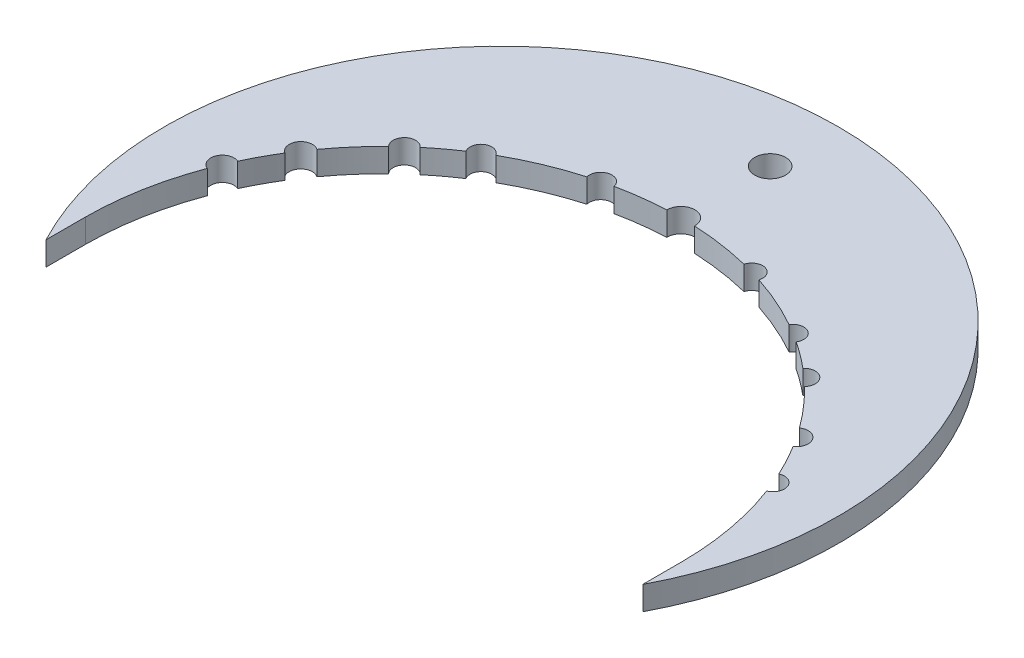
ISO-10303-21;
HEADER;
FILE_DESCRIPTION(('STEP AP214'),'2;1');
FILE_NAME('part.step','',(''),(''),'','','');
FILE_SCHEMA(('AUTOMOTIVE_DESIGN { 1 0 10303 214 1 1 1 1 }'));
ENDSEC;
DATA;
#1=APPLICATION_CONTEXT('core data for automotive mechanical design processes');
#2=APPLICATION_PROTOCOL_DEFINITION('international standard','automotive_design',2000,#1);
#3=PRODUCT_CONTEXT('',#1,'mechanical');
#4=PRODUCT('Part','Part','',(#3));
#5=PRODUCT_RELATED_PRODUCT_CATEGORY('part','',(#4));
#6=PRODUCT_DEFINITION_FORMATION('','',#4);
#7=PRODUCT_DEFINITION_CONTEXT('part definition',#1,'design');
#8=PRODUCT_DEFINITION('design','',#6,#7);
#9=PRODUCT_DEFINITION_SHAPE('','',#8);
#10=(LENGTH_UNIT() NAMED_UNIT(*) SI_UNIT(.MILLI.,.METRE.));
#11=(NAMED_UNIT(*) PLANE_ANGLE_UNIT() SI_UNIT($,.RADIAN.));
#12=(NAMED_UNIT(*) SI_UNIT($,.STERADIAN.) SOLID_ANGLE_UNIT());
#13=UNCERTAINTY_MEASURE_WITH_UNIT(LENGTH_MEASURE(1.E-05),#10,'distance_accuracy_value','');
#14=(GEOMETRIC_REPRESENTATION_CONTEXT(3) GLOBAL_UNCERTAINTY_ASSIGNED_CONTEXT((#13)) GLOBAL_UNIT_ASSIGNED_CONTEXT((#10,
#11,#12)) REPRESENTATION_CONTEXT('',''));
#15=CARTESIAN_POINT('',(0.,0.,0.));
#16=DIRECTION('',(0.,0.,1.));
#17=DIRECTION('',(1.,0.,0.));
#18=AXIS2_PLACEMENT_3D('',#15,#16,#17);
#19=CARTESIAN_POINT('',(19.2198140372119,5.,-60.7260260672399));
#20=DIRECTION('',(0.,-1.,0.));
#21=DIRECTION('',(0.,0.,-1.));
#22=AXIS2_PLACEMENT_3D('',#19,#20,#21);
#23=CYLINDRICAL_SURFACE('',#22,2.36515468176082);
#24=CARTESIAN_POINT('',(19.2198140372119,0.,-60.7260260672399));
#25=DIRECTION('',(0.,1.,0.));
#26=DIRECTION('',(0.,0.,1.));
#27=AXIS2_PLACEMENT_3D('',#24,#25,#26);
#28=CIRCLE('',#27,2.36515468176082);
#29=CARTESIAN_POINT('',(21.5261649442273,0.,-61.2501464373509));
#30=VERTEX_POINT('',#29);
#31=CARTESIAN_POINT('',(16.93482019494,0.,-60.115485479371));
#32=VERTEX_POINT('',#31);
#33=EDGE_CURVE('E254',#30,#32,#28,.T.);
#34=ORIENTED_EDGE('',*,*,#33,.F.);
#35=DIRECTION('',(0.,-1.,0.));
#36=VECTOR('',#35,1.);
#37=CARTESIAN_POINT('',(21.5261649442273,5.,-61.2501464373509));
#38=LINE('',#37,#36);
#39=CARTESIAN_POINT('',(21.5261649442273,5.,-61.2501464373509));
#40=VERTEX_POINT('',#39);
#41=EDGE_CURVE('E11',#40,#30,#38,.T.);
#42=ORIENTED_EDGE('',*,*,#41,.F.);
#43=CARTESIAN_POINT('',(19.2198140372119,5.,-60.7260260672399));
#44=DIRECTION('',(0.,1.,0.));
#45=DIRECTION('',(0.,0.,1.));
#46=AXIS2_PLACEMENT_3D('',#43,#44,#45);
#47=CIRCLE('',#46,2.36515468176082);
#48=CARTESIAN_POINT('',(16.93482019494,5.,-60.115485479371));
#49=VERTEX_POINT('',#48);
#50=EDGE_CURVE('E326',#40,#49,#47,.T.);
#51=ORIENTED_EDGE('',*,*,#50,.T.);
#52=DIRECTION('',(0.,-1.,0.));
#53=VECTOR('',#52,1.);
#54=CARTESIAN_POINT('',(16.93482019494,5.,-60.115485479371));
#55=LINE('',#54,#53);
#56=EDGE_CURVE('E146',#49,#32,#55,.T.);
#57=ORIENTED_EDGE('',*,*,#56,.T.);
#58=EDGE_LOOP('',(#34,#42,#51,#57));
#59=FACE_BOUND('',#58,.T.);
#60=ADVANCED_FACE('F41',(#59),#23,.F.);
#61=CARTESIAN_POINT('',(34.2957576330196,5.,0.277971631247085));
#62=DIRECTION('',(0.,-1.,0.));
#63=DIRECTION('',(0.,0.,-1.));
#64=AXIS2_PLACEMENT_3D('',#61,#62,#63);
#65=CYLINDRICAL_SURFACE('',#64,62.8392537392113);
#66=CARTESIAN_POINT('',(34.2957576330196,0.,0.277971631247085));
#67=DIRECTION('',(0.,1.,0.));
#68=DIRECTION('',(0.,0.,1.));
#69=AXIS2_PLACEMENT_3D('',#66,#67,#68);
#70=CIRCLE('',#69,62.8392537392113);
#71=CARTESIAN_POINT('',(31.374357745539,0.,-62.4933373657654));
#72=VERTEX_POINT('',#71);
#73=EDGE_CURVE('E258',#30,#72,#70,.F.);
#74=ORIENTED_EDGE('',*,*,#73,.T.);
#75=DIRECTION('',(0.,-1.,0.));
#76=VECTOR('',#75,1.);
#77=CARTESIAN_POINT('',(31.374357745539,5.,-62.4933373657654));
#78=LINE('',#77,#76);
#79=CARTESIAN_POINT('',(31.374357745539,5.,-62.4933373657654));
#80=VERTEX_POINT('',#79);
#81=EDGE_CURVE('E50',#80,#72,#78,.T.);
#82=ORIENTED_EDGE('',*,*,#81,.F.);
#83=CARTESIAN_POINT('',(34.2957576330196,5.,0.277971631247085));
#84=DIRECTION('',(0.,1.,0.));
#85=DIRECTION('',(0.,0.,1.));
#86=AXIS2_PLACEMENT_3D('',#83,#84,#85);
#87=CIRCLE('',#86,62.8392537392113);
#88=EDGE_CURVE('E247',#40,#80,#87,.F.);
#89=ORIENTED_EDGE('',*,*,#88,.F.);
#90=ORIENTED_EDGE('',*,*,#41,.T.);
#91=EDGE_LOOP('',(#74,#82,#89,#90));
#92=FACE_BOUND('',#91,.T.);
#93=ADVANCED_FACE('F404',(#92),#65,.F.);
#94=CARTESIAN_POINT('',(34.2957576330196,5.,-62.5612821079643));
#95=DIRECTION('',(0.,-1.,0.));
#96=DIRECTION('',(0.,0.,-1.));
#97=AXIS2_PLACEMENT_3D('',#94,#95,#96);
#98=CYLINDRICAL_SURFACE('',#97,2.92218989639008);
#99=CARTESIAN_POINT('',(34.2957576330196,0.,-62.5612821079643));
#100=DIRECTION('',(0.,1.,0.));
#101=DIRECTION('',(0.,0.,1.));
#102=AXIS2_PLACEMENT_3D('',#99,#100,#101);
#103=CIRCLE('',#102,2.92218989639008);
#104=CARTESIAN_POINT('',(37.2171575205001,0.,-62.4933373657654));
#105=VERTEX_POINT('',#104);
#106=EDGE_CURVE('E262',#105,#72,#103,.T.);
#107=ORIENTED_EDGE('',*,*,#106,.F.);
#108=DIRECTION('',(0.,-1.,0.));
#109=VECTOR('',#108,1.);
#110=CARTESIAN_POINT('',(37.2171575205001,5.,-62.4933373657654));
#111=LINE('',#110,#109);
#112=CARTESIAN_POINT('',(37.2171575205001,5.,-62.4933373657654));
#113=VERTEX_POINT('',#112);
#114=EDGE_CURVE('E392',#113,#105,#111,.T.);
#115=ORIENTED_EDGE('',*,*,#114,.F.);
#116=CARTESIAN_POINT('',(34.2957576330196,5.,-62.5612821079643));
#117=DIRECTION('',(0.,1.,0.));
#118=DIRECTION('',(0.,0.,1.));
#119=AXIS2_PLACEMENT_3D('',#116,#117,#118);
#120=CIRCLE('',#119,2.92218989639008);
#121=EDGE_CURVE('E401',#113,#80,#120,.T.);
#122=ORIENTED_EDGE('',*,*,#121,.T.);
#123=ORIENTED_EDGE('',*,*,#81,.T.);
#124=EDGE_LOOP('',(#107,#115,#122,#123));
#125=FACE_BOUND('',#124,.T.);
#126=ADVANCED_FACE('F399',(#125),#98,.F.);
#127=CARTESIAN_POINT('',(49.412267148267,0.,-60.7159866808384));
#128=VERTEX_POINT('',#127);
#129=EDGE_CURVE('E264',#105,#128,#70,.F.);
#130=ORIENTED_EDGE('',*,*,#129,.T.);
#131=DIRECTION('',(0.,-1.,0.));
#132=VECTOR('',#131,1.);
#133=CARTESIAN_POINT('',(49.412267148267,5.,-60.7159866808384));
#134=LINE('',#133,#132);
#135=CARTESIAN_POINT('',(49.412267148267,5.,-60.7159866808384));
#136=VERTEX_POINT('',#135);
#137=EDGE_CURVE('E389',#136,#128,#134,.T.);
#138=ORIENTED_EDGE('',*,*,#137,.F.);
#139=EDGE_CURVE('E594',#113,#136,#87,.F.);
#140=ORIENTED_EDGE('',*,*,#139,.F.);
#141=ORIENTED_EDGE('',*,*,#114,.T.);
#142=EDGE_LOOP('',(#130,#138,#140,#141));
#143=FACE_BOUND('',#142,.T.);
#144=ADVANCED_FACE('F461',(#143),#65,.F.);
#145=CARTESIAN_POINT('',(51.6359486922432,5.,-60.1214454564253));
#146=DIRECTION('',(0.,-1.,0.));
#147=DIRECTION('',(0.,0.,-1.));
#148=AXIS2_PLACEMENT_3D('',#145,#146,#147);
#149=CYLINDRICAL_SURFACE('',#148,2.30179036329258);
#150=CARTESIAN_POINT('',(51.6359486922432,0.,-60.1214454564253));
#151=DIRECTION('',(0.,1.,0.));
#152=DIRECTION('',(0.,0.,1.));
#153=AXIS2_PLACEMENT_3D('',#150,#151,#152);
#154=CIRCLE('',#153,2.30179036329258);
#155=CARTESIAN_POINT('',(53.8363641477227,0.,-59.4458637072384));
#156=VERTEX_POINT('',#155);
#157=EDGE_CURVE('E268',#156,#128,#154,.T.);
#158=ORIENTED_EDGE('',*,*,#157,.F.);
#159=DIRECTION('',(0.,-1.,0.));
#160=VECTOR('',#159,1.);
#161=CARTESIAN_POINT('',(53.8363641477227,5.,-59.4458637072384));
#162=LINE('',#161,#160);
#163=CARTESIAN_POINT('',(53.8363641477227,5.,-59.4458637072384));
#164=VERTEX_POINT('',#163);
#165=EDGE_CURVE('E386',#164,#156,#162,.T.);
#166=ORIENTED_EDGE('',*,*,#165,.F.);
#167=CARTESIAN_POINT('',(51.6359486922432,5.,-60.1214454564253));
#168=DIRECTION('',(0.,1.,0.));
#169=DIRECTION('',(0.,0.,1.));
#170=AXIS2_PLACEMENT_3D('',#167,#168,#169);
#171=CIRCLE('',#170,2.30179036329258);
#172=EDGE_CURVE('E597',#164,#136,#171,.T.);
#173=ORIENTED_EDGE('',*,*,#172,.T.);
#174=ORIENTED_EDGE('',*,*,#137,.T.);
#175=EDGE_LOOP('',(#158,#166,#173,#174));
#176=FACE_BOUND('',#175,.T.);
#177=ADVANCED_FACE('F468',(#176),#149,.F.);
#178=CARTESIAN_POINT('',(65.1790621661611,0.,-54.448560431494));
#179=VERTEX_POINT('',#178);
#180=EDGE_CURVE('E272',#156,#179,#70,.F.);
#181=ORIENTED_EDGE('',*,*,#180,.T.);
#182=DIRECTION('',(0.,-1.,0.));
#183=VECTOR('',#182,1.);
#184=CARTESIAN_POINT('',(65.1790621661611,5.,-54.448560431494));
#185=LINE('',#184,#183);
#186=CARTESIAN_POINT('',(65.1790621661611,5.,-54.448560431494));
#187=VERTEX_POINT('',#186);
#188=EDGE_CURVE('E383',#187,#179,#185,.T.);
#189=ORIENTED_EDGE('',*,*,#188,.F.);
#190=EDGE_CURVE('E601',#164,#187,#87,.F.);
#191=ORIENTED_EDGE('',*,*,#190,.F.);
#192=ORIENTED_EDGE('',*,*,#165,.T.);
#193=EDGE_LOOP('',(#181,#189,#191,#192));
#194=FACE_BOUND('',#193,.T.);
#195=ADVANCED_FACE('F469',(#194),#65,.F.);
#196=CARTESIAN_POINT('',(67.1453030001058,5.,-53.2914149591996));
#197=DIRECTION('',(0.,-1.,0.));
#198=DIRECTION('',(0.,0.,-1.));
#199=AXIS2_PLACEMENT_3D('',#196,#197,#198);
#200=CYLINDRICAL_SURFACE('',#199,2.28146634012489);
#201=CARTESIAN_POINT('',(67.1453030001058,0.,-53.2914149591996));
#202=DIRECTION('',(0.,1.,0.));
#203=DIRECTION('',(0.,0.,1.));
#204=AXIS2_PLACEMENT_3D('',#201,#202,#203);
#205=CIRCLE('',#204,2.28146634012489);
#206=CARTESIAN_POINT('',(69.0682430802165,0.,-52.0636567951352));
#207=VERTEX_POINT('',#206);
#208=EDGE_CURVE('E273',#207,#179,#205,.T.);
#209=ORIENTED_EDGE('',*,*,#208,.F.);
#210=DIRECTION('',(0.,-1.,0.));
#211=VECTOR('',#210,1.);
#212=CARTESIAN_POINT('',(69.0682430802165,5.,-52.0636567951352));
#213=LINE('',#212,#211);
#214=CARTESIAN_POINT('',(69.0682430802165,5.,-52.0636567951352));
#215=VERTEX_POINT('',#214);
#216=EDGE_CURVE('E380',#215,#207,#213,.T.);
#217=ORIENTED_EDGE('',*,*,#216,.F.);
#218=CARTESIAN_POINT('',(67.1453030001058,5.,-53.2914149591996));
#219=DIRECTION('',(0.,1.,0.));
#220=DIRECTION('',(0.,0.,1.));
#221=AXIS2_PLACEMENT_3D('',#218,#219,#220);
#222=CIRCLE('',#221,2.28146634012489);
#223=EDGE_CURVE('E602',#215,#187,#222,.T.);
#224=ORIENTED_EDGE('',*,*,#223,.T.);
#225=ORIENTED_EDGE('',*,*,#188,.T.);
#226=EDGE_LOOP('',(#209,#217,#224,#225));
#227=FACE_BOUND('',#226,.T.);
#228=ADVANCED_FACE('F539',(#227),#200,.F.);
#229=CARTESIAN_POINT('',(74.5943812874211,0.,-47.9381329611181));
#230=VERTEX_POINT('',#229);
#231=EDGE_CURVE('E277',#207,#230,#70,.F.);
#232=ORIENTED_EDGE('',*,*,#231,.T.);
#233=DIRECTION('',(0.,-1.,0.));
#234=VECTOR('',#233,1.);
#235=CARTESIAN_POINT('',(74.5943812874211,5.,-47.9381329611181));
#236=LINE('',#235,#234);
#237=CARTESIAN_POINT('',(74.5943812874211,5.,-47.9381329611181));
#238=VERTEX_POINT('',#237);
#239=EDGE_CURVE('E377',#238,#230,#236,.T.);
#240=ORIENTED_EDGE('',*,*,#239,.F.);
#241=EDGE_CURVE('E606',#215,#238,#87,.F.);
#242=ORIENTED_EDGE('',*,*,#241,.F.);
#243=ORIENTED_EDGE('',*,*,#216,.T.);
#244=EDGE_LOOP('',(#232,#240,#242,#243));
#245=FACE_BOUND('',#244,.T.);
#246=ADVANCED_FACE('F532',(#245),#65,.F.);
#247=CARTESIAN_POINT('',(76.3714492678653,5.,-46.395446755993));
#248=DIRECTION('',(0.,-1.,0.));
#249=DIRECTION('',(0.,0.,-1.));
#250=AXIS2_PLACEMENT_3D('',#247,#248,#249);
#251=CYLINDRICAL_SURFACE('',#250,2.35326397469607);
#252=CARTESIAN_POINT('',(76.3714492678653,0.,-46.395446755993));
#253=DIRECTION('',(0.,1.,0.));
#254=DIRECTION('',(0.,0.,1.));
#255=AXIS2_PLACEMENT_3D('',#252,#253,#254);
#256=CIRCLE('',#255,2.35326397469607);
#257=CARTESIAN_POINT('',(78.0895092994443,0.,-44.7873046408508));
#258=VERTEX_POINT('',#257);
#259=EDGE_CURVE('E278',#258,#230,#256,.T.);
#260=ORIENTED_EDGE('',*,*,#259,.F.);
#261=DIRECTION('',(0.,-1.,0.));
#262=VECTOR('',#261,1.);
#263=CARTESIAN_POINT('',(78.0895092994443,5.,-44.7873046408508));
#264=LINE('',#263,#262);
#265=CARTESIAN_POINT('',(78.0895092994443,5.,-44.7873046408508));
#266=VERTEX_POINT('',#265);
#267=EDGE_CURVE('E374',#266,#258,#264,.T.);
#268=ORIENTED_EDGE('',*,*,#267,.F.);
#269=CARTESIAN_POINT('',(76.3714492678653,5.,-46.395446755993));
#270=DIRECTION('',(0.,1.,0.));
#271=DIRECTION('',(0.,0.,1.));
#272=AXIS2_PLACEMENT_3D('',#269,#270,#271);
#273=CIRCLE('',#272,2.35326397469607);
#274=EDGE_CURVE('E607',#266,#238,#273,.T.);
#275=ORIENTED_EDGE('',*,*,#274,.T.);
#276=ORIENTED_EDGE('',*,*,#239,.T.);
#277=EDGE_LOOP('',(#260,#268,#275,#276));
#278=FACE_BOUND('',#277,.T.);
#279=ADVANCED_FACE('F531',(#278),#251,.F.);
#280=CARTESIAN_POINT('',(85.1011740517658,0.,-36.7028541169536));
#281=VERTEX_POINT('',#280);
#282=EDGE_CURVE('E282',#258,#281,#70,.F.);
#283=ORIENTED_EDGE('',*,*,#282,.T.);
#284=DIRECTION('',(0.,-1.,0.));
#285=VECTOR('',#284,1.);
#286=CARTESIAN_POINT('',(85.1011740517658,5.,-36.7028541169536));
#287=LINE('',#286,#285);
#288=CARTESIAN_POINT('',(85.1011740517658,5.,-36.7028541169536));
#289=VERTEX_POINT('',#288);
#290=EDGE_CURVE('E371',#289,#281,#287,.T.);
#291=ORIENTED_EDGE('',*,*,#290,.F.);
#292=EDGE_CURVE('E611',#266,#289,#87,.F.);
#293=ORIENTED_EDGE('',*,*,#292,.F.);
#294=ORIENTED_EDGE('',*,*,#267,.T.);
#295=EDGE_LOOP('',(#283,#291,#293,#294));
#296=FACE_BOUND('',#295,.T.);
#297=ADVANCED_FACE('F524',(#296),#65,.F.);
#298=CARTESIAN_POINT('',(86.4952526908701,5.,-34.7075185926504));
#299=DIRECTION('',(0.,-1.,0.));
#300=DIRECTION('',(0.,0.,-1.));
#301=AXIS2_PLACEMENT_3D('',#298,#299,#300);
#302=CYLINDRICAL_SURFACE('',#301,2.43409513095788);
#303=CARTESIAN_POINT('',(86.4952526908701,0.,-34.7075185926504));
#304=DIRECTION('',(0.,1.,0.));
#305=DIRECTION('',(0.,0.,1.));
#306=AXIS2_PLACEMENT_3D('',#303,#304,#305);
#307=CIRCLE('',#306,2.43409513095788);
#308=CARTESIAN_POINT('',(87.8110101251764,0.,-32.6596901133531));
#309=VERTEX_POINT('',#308);
#310=EDGE_CURVE('E283',#309,#281,#307,.T.);
#311=ORIENTED_EDGE('',*,*,#310,.F.);
#312=DIRECTION('',(0.,-1.,0.));
#313=VECTOR('',#312,1.);
#314=CARTESIAN_POINT('',(87.8110101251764,5.,-32.6596901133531));
#315=LINE('',#314,#313);
#316=CARTESIAN_POINT('',(87.8110101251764,5.,-32.6596901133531));
#317=VERTEX_POINT('',#316);
#318=EDGE_CURVE('E368',#317,#309,#315,.T.);
#319=ORIENTED_EDGE('',*,*,#318,.F.);
#320=CARTESIAN_POINT('',(86.4952526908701,5.,-34.7075185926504));
#321=DIRECTION('',(0.,1.,0.));
#322=DIRECTION('',(0.,0.,1.));
#323=AXIS2_PLACEMENT_3D('',#320,#321,#322);
#324=CIRCLE('',#323,2.43409513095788);
#325=EDGE_CURVE('E612',#317,#289,#324,.T.);
#326=ORIENTED_EDGE('',*,*,#325,.T.);
#327=ORIENTED_EDGE('',*,*,#290,.T.);
#328=EDGE_LOOP('',(#311,#319,#326,#327));
#329=FACE_BOUND('',#328,.T.);
#330=ADVANCED_FACE('F523',(#329),#302,.F.);
#331=CARTESIAN_POINT('',(91.3080598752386,0.,-26.1487043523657));
#332=VERTEX_POINT('',#331);
#333=EDGE_CURVE('E287',#309,#332,#70,.F.);
#334=ORIENTED_EDGE('',*,*,#333,.T.);
#335=DIRECTION('',(0.,-1.,0.));
#336=VECTOR('',#335,1.);
#337=CARTESIAN_POINT('',(91.3080598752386,5.,-26.1487043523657));
#338=LINE('',#337,#336);
#339=CARTESIAN_POINT('',(91.3080598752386,5.,-26.1487043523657));
#340=VERTEX_POINT('',#339);
#341=EDGE_CURVE('E365',#340,#332,#338,.T.);
#342=ORIENTED_EDGE('',*,*,#341,.F.);
#343=EDGE_CURVE('E616',#317,#340,#87,.F.);
#344=ORIENTED_EDGE('',*,*,#343,.F.);
#345=ORIENTED_EDGE('',*,*,#318,.T.);
#346=EDGE_LOOP('',(#334,#342,#344,#345));
#347=FACE_BOUND('',#346,.T.);
#348=ADVANCED_FACE('F513',(#347),#65,.F.);
#349=CARTESIAN_POINT('',(92.2695068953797,5.,-23.9669496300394));
#350=DIRECTION('',(0.,-1.,0.));
#351=DIRECTION('',(0.,0.,-1.));
#352=AXIS2_PLACEMENT_3D('',#349,#350,#351);
#353=CYLINDRICAL_SURFACE('',#352,2.3842051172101);
#354=CARTESIAN_POINT('',(92.2695068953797,0.,-23.9669496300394));
#355=DIRECTION('',(0.,1.,0.));
#356=DIRECTION('',(0.,0.,1.));
#357=AXIS2_PLACEMENT_3D('',#354,#355,#356);
#358=CIRCLE('',#357,2.3842051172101);
#359=CARTESIAN_POINT('',(93.1474981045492,0.,-21.7502932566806));
#360=VERTEX_POINT('',#359);
#361=EDGE_CURVE('E288',#360,#332,#358,.T.);
#362=ORIENTED_EDGE('',*,*,#361,.F.);
#363=DIRECTION('',(0.,-1.,0.));
#364=VECTOR('',#363,1.);
#365=CARTESIAN_POINT('',(93.1474981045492,5.,-21.7502932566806));
#366=LINE('',#365,#364);
#367=CARTESIAN_POINT('',(93.1474981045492,5.,-21.7502932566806));
#368=VERTEX_POINT('',#367);
#369=EDGE_CURVE('E362',#368,#360,#366,.T.);
#370=ORIENTED_EDGE('',*,*,#369,.F.);
#371=CARTESIAN_POINT('',(92.2695068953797,5.,-23.9669496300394));
#372=DIRECTION('',(0.,1.,0.));
#373=DIRECTION('',(0.,0.,1.));
#374=AXIS2_PLACEMENT_3D('',#371,#372,#373);
#375=CIRCLE('',#374,2.3842051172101);
#376=EDGE_CURVE('E617',#368,#340,#375,.T.);
#377=ORIENTED_EDGE('',*,*,#376,.T.);
#378=ORIENTED_EDGE('',*,*,#341,.T.);
#379=EDGE_LOOP('',(#362,#370,#377,#378));
#380=FACE_BOUND('',#379,.T.);
#381=ADVANCED_FACE('F512',(#380),#353,.F.);
#382=CARTESIAN_POINT('',(97.134396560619,0.,0.));
#383=VERTEX_POINT('',#382);
#384=EDGE_CURVE('E292',#360,#383,#70,.F.);
#385=ORIENTED_EDGE('',*,*,#384,.T.);
#386=DIRECTION('',(0.,-1.,0.));
#387=VECTOR('',#386,1.);
#388=CARTESIAN_POINT('',(97.134396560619,5.,0.));
#389=LINE('',#388,#387);
#390=CARTESIAN_POINT('',(97.134396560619,5.,0.));
#391=VERTEX_POINT('',#390);
#392=EDGE_CURVE('E358',#391,#383,#389,.T.);
#393=ORIENTED_EDGE('',*,*,#392,.F.);
#394=EDGE_CURVE('E575',#368,#391,#87,.F.);
#395=ORIENTED_EDGE('',*,*,#394,.F.);
#396=ORIENTED_EDGE('',*,*,#369,.T.);
#397=EDGE_LOOP('',(#385,#393,#395,#396));
#398=FACE_BOUND('',#397,.T.);
#399=ADVANCED_FACE('F503',(#398),#65,.F.);
#400=CARTESIAN_POINT('',(97.134396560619,5.,0.));
#401=DIRECTION('',(1.,0.,0.));
#402=DIRECTION('',(0.,0.,-1.));
#403=AXIS2_PLACEMENT_3D('',#400,#401,#402);
#404=PLANE('',#403);
#405=DIRECTION('',(0.,0.,1.));
#406=VECTOR('',#405,1.);
#407=CARTESIAN_POINT('',(97.134396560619,0.,0.));
#408=LINE('',#407,#406);
#409=CARTESIAN_POINT('',(97.134396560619,0.,8.31306140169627));
#410=VERTEX_POINT('',#409);
#411=EDGE_CURVE('E293',#383,#410,#408,.T.);
#412=ORIENTED_EDGE('',*,*,#411,.T.);
#413=DIRECTION('',(0.,-1.,0.));
#414=VECTOR('',#413,1.);
#415=CARTESIAN_POINT('',(97.134396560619,5.,8.31306140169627));
#416=LINE('',#415,#414);
#417=CARTESIAN_POINT('',(97.134396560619,5.,8.31306140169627));
#418=VERTEX_POINT('',#417);
#419=EDGE_CURVE('E354',#418,#410,#416,.T.);
#420=ORIENTED_EDGE('',*,*,#419,.F.);
#421=DIRECTION('',(0.,0.,1.));
#422=VECTOR('',#421,1.);
#423=CARTESIAN_POINT('',(97.134396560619,5.,0.));
#424=LINE('',#423,#422);
#425=EDGE_CURVE('E577',#391,#418,#424,.T.);
#426=ORIENTED_EDGE('',*,*,#425,.F.);
#427=ORIENTED_EDGE('',*,*,#392,.T.);
#428=EDGE_LOOP('',(#412,#420,#426,#427));
#429=FACE_BOUND('',#428,.T.);
#430=ADVANCED_FACE('F511',(#429),#404,.F.);
#431=CARTESIAN_POINT('',(34.2957576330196,5.,-24.733413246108));
#432=DIRECTION('',(0.,-1.,0.));
#433=DIRECTION('',(0.,0.,-1.));
#434=AXIS2_PLACEMENT_3D('',#431,#432,#433);
#435=CYLINDRICAL_SURFACE('',#434,70.9983382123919);
#436=CARTESIAN_POINT('',(34.2957576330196,0.,-24.733413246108));
#437=DIRECTION('',(0.,1.,0.));
#438=DIRECTION('',(0.,0.,1.));
#439=AXIS2_PLACEMENT_3D('',#436,#437,#438);
#440=CIRCLE('',#439,70.9983382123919);
#441=CARTESIAN_POINT('',(-28.5428812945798,0.,8.31306140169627));
#442=VERTEX_POINT('',#441);
#443=EDGE_CURVE('E296',#410,#442,#440,.T.);
#444=ORIENTED_EDGE('',*,*,#443,.T.);
#445=DIRECTION('',(0.,-1.,0.));
#446=VECTOR('',#445,1.);
#447=CARTESIAN_POINT('',(-28.5428812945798,5.,8.31306140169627));
#448=LINE('',#447,#446);
#449=CARTESIAN_POINT('',(-28.5428812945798,5.,8.31306140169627));
#450=VERTEX_POINT('',#449);
#451=EDGE_CURVE('E351',#450,#442,#448,.T.);
#452=ORIENTED_EDGE('',*,*,#451,.F.);
#453=CARTESIAN_POINT('',(34.2957576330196,5.,-24.733413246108));
#454=DIRECTION('',(0.,1.,0.));
#455=DIRECTION('',(0.,0.,1.));
#456=AXIS2_PLACEMENT_3D('',#453,#454,#455);
#457=CIRCLE('',#456,70.9983382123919);
#458=EDGE_CURVE('E570',#418,#450,#457,.T.);
#459=ORIENTED_EDGE('',*,*,#458,.F.);
#460=ORIENTED_EDGE('',*,*,#419,.T.);
#461=EDGE_LOOP('',(#444,#452,#459,#460));
#462=FACE_BOUND('',#461,.T.);
#463=ADVANCED_FACE('F507',(#462),#435,.T.);
#464=CARTESIAN_POINT('',(-28.5428812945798,5.,0.));
#465=DIRECTION('',(1.,0.,0.));
#466=DIRECTION('',(0.,0.,-1.));
#467=AXIS2_PLACEMENT_3D('',#464,#465,#466);
#468=PLANE('',#467);
#469=DIRECTION('',(0.,0.,1.));
#470=VECTOR('',#469,1.);
#471=CARTESIAN_POINT('',(-28.5428812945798,0.,0.));
#472=LINE('',#471,#470);
#473=CARTESIAN_POINT('',(-28.5428812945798,0.,0.));
#474=VERTEX_POINT('',#473);
#475=EDGE_CURVE('E300',#474,#442,#472,.T.);
#476=ORIENTED_EDGE('',*,*,#475,.F.);
#477=DIRECTION('',(0.,-1.,0.));
#478=VECTOR('',#477,1.);
#479=CARTESIAN_POINT('',(-28.5428812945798,5.,0.));
#480=LINE('',#479,#478);
#481=CARTESIAN_POINT('',(-28.5428812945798,5.,0.));
#482=VERTEX_POINT('',#481);
#483=EDGE_CURVE('E348',#482,#474,#480,.T.);
#484=ORIENTED_EDGE('',*,*,#483,.F.);
#485=DIRECTION('',(0.,0.,1.));
#486=VECTOR('',#485,1.);
#487=CARTESIAN_POINT('',(-28.5428812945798,5.,0.));
#488=LINE('',#487,#486);
#489=EDGE_CURVE('E567',#482,#450,#488,.T.);
#490=ORIENTED_EDGE('',*,*,#489,.T.);
#491=ORIENTED_EDGE('',*,*,#451,.T.);
#492=EDGE_LOOP('',(#476,#484,#490,#491));
#493=FACE_BOUND('',#492,.T.);
#494=ADVANCED_FACE('F502',(#493),#468,.T.);
#495=CARTESIAN_POINT('',(-24.5787848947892,0.,-21.6892779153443));
#496=VERTEX_POINT('',#495);
#497=EDGE_CURVE('E304',#474,#496,#70,.F.);
#498=ORIENTED_EDGE('',*,*,#497,.T.);
#499=DIRECTION('',(0.,-1.,0.));
#500=VECTOR('',#499,1.);
#501=CARTESIAN_POINT('',(-24.5787848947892,5.,-21.6892779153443));
#502=LINE('',#501,#500);
#503=CARTESIAN_POINT('',(-24.5787848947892,5.,-21.6892779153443));
#504=VERTEX_POINT('',#503);
#505=EDGE_CURVE('E345',#504,#496,#502,.T.);
#506=ORIENTED_EDGE('',*,*,#505,.F.);
#507=EDGE_CURVE('E569',#482,#504,#87,.F.);
#508=ORIENTED_EDGE('',*,*,#507,.F.);
#509=ORIENTED_EDGE('',*,*,#483,.T.);
#510=EDGE_LOOP('',(#498,#506,#508,#509));
#511=FACE_BOUND('',#510,.T.);
#512=ADVANCED_FACE('F495',(#511),#65,.F.);
#513=CARTESIAN_POINT('',(-23.6779916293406,5.,-23.9669496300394));
#514=DIRECTION('',(0.,-1.,0.));
#515=DIRECTION('',(0.,0.,-1.));
#516=AXIS2_PLACEMENT_3D('',#513,#514,#515);
#517=CYLINDRICAL_SURFACE('',#516,2.44932989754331);
#518=CARTESIAN_POINT('',(-23.6779916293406,0.,-23.9669496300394));
#519=DIRECTION('',(0.,1.,0.));
#520=DIRECTION('',(0.,0.,1.));
#521=AXIS2_PLACEMENT_3D('',#518,#519,#520);
#522=CIRCLE('',#521,2.44932989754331);
#523=CARTESIAN_POINT('',(-22.6891210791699,0.,-26.2077869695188));
#524=VERTEX_POINT('',#523);
#525=EDGE_CURVE('E305',#524,#496,#522,.T.);
#526=ORIENTED_EDGE('',*,*,#525,.F.);
#527=DIRECTION('',(0.,-1.,0.));
#528=VECTOR('',#527,1.);
#529=CARTESIAN_POINT('',(-22.6891210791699,5.,-26.2077869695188));
#530=LINE('',#529,#528);
#531=CARTESIAN_POINT('',(-22.6891210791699,5.,-26.2077869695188));
#532=VERTEX_POINT('',#531);
#533=EDGE_CURVE('E342',#532,#524,#530,.T.);
#534=ORIENTED_EDGE('',*,*,#533,.F.);
#535=CARTESIAN_POINT('',(-23.6779916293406,5.,-23.9669496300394));
#536=DIRECTION('',(0.,1.,0.));
#537=DIRECTION('',(0.,0.,1.));
#538=AXIS2_PLACEMENT_3D('',#535,#536,#537);
#539=CIRCLE('',#538,2.44932989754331);
#540=EDGE_CURVE('E574',#532,#504,#539,.T.);
#541=ORIENTED_EDGE('',*,*,#540,.T.);
#542=ORIENTED_EDGE('',*,*,#505,.T.);
#543=EDGE_LOOP('',(#526,#534,#541,#542));
#544=FACE_BOUND('',#543,.T.);
#545=ADVANCED_FACE('F494',(#544),#517,.F.);
#546=CARTESIAN_POINT('',(-19.2194948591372,0.,-32.6596901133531));
#547=VERTEX_POINT('',#546);
#548=EDGE_CURVE('E309',#524,#547,#70,.F.);
#549=ORIENTED_EDGE('',*,*,#548,.T.);
#550=DIRECTION('',(0.,-1.,0.));
#551=VECTOR('',#550,1.);
#552=CARTESIAN_POINT('',(-19.2194948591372,5.,-32.6596901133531));
#553=LINE('',#552,#551);
#554=CARTESIAN_POINT('',(-19.2194948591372,5.,-32.6596901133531));
#555=VERTEX_POINT('',#554);
#556=EDGE_CURVE('E339',#555,#547,#553,.T.);
#557=ORIENTED_EDGE('',*,*,#556,.F.);
#558=EDGE_CURVE('E576',#532,#555,#87,.F.);
#559=ORIENTED_EDGE('',*,*,#558,.F.);
#560=ORIENTED_EDGE('',*,*,#533,.T.);
#561=EDGE_LOOP('',(#549,#557,#559,#560));
#562=FACE_BOUND('',#561,.T.);
#563=ADVANCED_FACE('F487',(#562),#65,.F.);
#564=CARTESIAN_POINT('',(-17.9037374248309,5.,-34.7075185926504));
#565=DIRECTION('',(0.,-1.,0.));
#566=DIRECTION('',(0.,0.,-1.));
#567=AXIS2_PLACEMENT_3D('',#564,#565,#566);
#568=CYLINDRICAL_SURFACE('',#567,2.43409513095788);
#569=CARTESIAN_POINT('',(-17.9037374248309,0.,-34.7075185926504));
#570=DIRECTION('',(0.,1.,0.));
#571=DIRECTION('',(0.,0.,1.));
#572=AXIS2_PLACEMENT_3D('',#569,#570,#571);
#573=CIRCLE('',#572,2.43409513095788);
#574=CARTESIAN_POINT('',(-16.5096587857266,0.,-36.7028541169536));
#575=VERTEX_POINT('',#574);
#576=EDGE_CURVE('E310',#575,#547,#573,.T.);
#577=ORIENTED_EDGE('',*,*,#576,.F.);
#578=DIRECTION('',(0.,-1.,0.));
#579=VECTOR('',#578,1.);
#580=CARTESIAN_POINT('',(-16.5096587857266,5.,-36.7028541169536));
#581=LINE('',#580,#579);
#582=CARTESIAN_POINT('',(-16.5096587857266,5.,-36.7028541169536));
#583=VERTEX_POINT('',#582);
#584=EDGE_CURVE('E336',#583,#575,#581,.T.);
#585=ORIENTED_EDGE('',*,*,#584,.F.);
#586=CARTESIAN_POINT('',(-17.9037374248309,5.,-34.7075185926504));
#587=DIRECTION('',(0.,1.,0.));
#588=DIRECTION('',(0.,0.,1.));
#589=AXIS2_PLACEMENT_3D('',#586,#587,#588);
#590=CIRCLE('',#589,2.43409513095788);
#591=EDGE_CURVE('E583',#583,#555,#590,.T.);
#592=ORIENTED_EDGE('',*,*,#591,.T.);
#593=ORIENTED_EDGE('',*,*,#556,.T.);
#594=EDGE_LOOP('',(#577,#585,#592,#593));
#595=FACE_BOUND('',#594,.T.);
#596=ADVANCED_FACE('F486',(#595),#568,.F.);
#597=CARTESIAN_POINT('',(-9.49799403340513,0.,-44.7873046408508));
#598=VERTEX_POINT('',#597);
#599=EDGE_CURVE('E314',#575,#598,#70,.F.);
#600=ORIENTED_EDGE('',*,*,#599,.T.);
#601=DIRECTION('',(0.,-1.,0.));
#602=VECTOR('',#601,1.);
#603=CARTESIAN_POINT('',(-9.49799403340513,5.,-44.7873046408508));
#604=LINE('',#603,#602);
#605=CARTESIAN_POINT('',(-9.49799403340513,5.,-44.7873046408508));
#606=VERTEX_POINT('',#605);
#607=EDGE_CURVE('E333',#606,#598,#604,.T.);
#608=ORIENTED_EDGE('',*,*,#607,.F.);
#609=EDGE_CURVE('E230',#583,#606,#87,.F.);
#610=ORIENTED_EDGE('',*,*,#609,.F.);
#611=ORIENTED_EDGE('',*,*,#584,.T.);
#612=EDGE_LOOP('',(#600,#608,#610,#611));
#613=FACE_BOUND('',#612,.T.);
#614=ADVANCED_FACE('F479',(#613),#65,.F.);
#615=CARTESIAN_POINT('',(-7.77993400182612,5.,-46.395446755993));
#616=DIRECTION('',(0.,-1.,0.));
#617=DIRECTION('',(0.,0.,-1.));
#618=AXIS2_PLACEMENT_3D('',#615,#616,#617);
#619=CYLINDRICAL_SURFACE('',#618,2.35326397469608);
#620=CARTESIAN_POINT('',(-7.77993400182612,0.,-46.395446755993));
#621=DIRECTION('',(0.,1.,0.));
#622=DIRECTION('',(0.,0.,1.));
#623=AXIS2_PLACEMENT_3D('',#620,#621,#622);
#624=CIRCLE('',#623,2.35326397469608);
#625=CARTESIAN_POINT('',(-6.00286602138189,0.,-47.9381329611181));
#626=VERTEX_POINT('',#625);
#627=EDGE_CURVE('E315',#626,#598,#624,.T.);
#628=ORIENTED_EDGE('',*,*,#627,.F.);
#629=DIRECTION('',(0.,-1.,0.));
#630=VECTOR('',#629,1.);
#631=CARTESIAN_POINT('',(-6.00286602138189,5.,-47.9381329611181));
#632=LINE('',#631,#630);
#633=CARTESIAN_POINT('',(-6.00286602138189,5.,-47.9381329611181));
#634=VERTEX_POINT('',#633);
#635=EDGE_CURVE('E240',#634,#626,#632,.T.);
#636=ORIENTED_EDGE('',*,*,#635,.F.);
#637=CARTESIAN_POINT('',(-7.77993400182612,5.,-46.395446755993));
#638=DIRECTION('',(0.,1.,0.));
#639=DIRECTION('',(0.,0.,1.));
#640=AXIS2_PLACEMENT_3D('',#637,#638,#639);
#641=CIRCLE('',#640,2.35326397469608);
#642=EDGE_CURVE('E226',#634,#606,#641,.T.);
#643=ORIENTED_EDGE('',*,*,#642,.T.);
#644=ORIENTED_EDGE('',*,*,#607,.T.);
#645=EDGE_LOOP('',(#628,#636,#643,#644));
#646=FACE_BOUND('',#645,.T.);
#647=ADVANCED_FACE('F478',(#646),#619,.F.);
#648=CARTESIAN_POINT('',(-0.476727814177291,0.,-52.0636567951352));
#649=VERTEX_POINT('',#648);
#650=EDGE_CURVE('E235',#626,#649,#70,.F.);
#651=ORIENTED_EDGE('',*,*,#650,.T.);
#652=DIRECTION('',(0.,-1.,0.));
#653=VECTOR('',#652,1.);
#654=CARTESIAN_POINT('',(-0.476727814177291,5.,-52.0636567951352));
#655=LINE('',#654,#653);
#656=CARTESIAN_POINT('',(-0.476727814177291,5.,-52.0636567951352));
#657=VERTEX_POINT('',#656);
#658=EDGE_CURVE('E232',#657,#649,#655,.T.);
#659=ORIENTED_EDGE('',*,*,#658,.F.);
#660=EDGE_CURVE('E219',#634,#657,#87,.F.);
#661=ORIENTED_EDGE('',*,*,#660,.F.);
#662=ORIENTED_EDGE('',*,*,#635,.T.);
#663=EDGE_LOOP('',(#651,#659,#661,#662));
#664=FACE_BOUND('',#663,.T.);
#665=ADVANCED_FACE('F233',(#664),#65,.F.);
#666=CARTESIAN_POINT('',(1.44621226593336,5.,-53.2914149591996));
#667=DIRECTION('',(0.,-1.,0.));
#668=DIRECTION('',(0.,0.,-1.));
#669=AXIS2_PLACEMENT_3D('',#666,#667,#668);
#670=CYLINDRICAL_SURFACE('',#669,2.28146634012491);
#671=CARTESIAN_POINT('',(1.44621226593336,0.,-53.2914149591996));
#672=DIRECTION('',(0.,1.,0.));
#673=DIRECTION('',(0.,0.,1.));
#674=AXIS2_PLACEMENT_3D('',#671,#672,#673);
#675=CIRCLE('',#674,2.28146634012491);
#676=CARTESIAN_POINT('',(3.41245309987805,0.,-54.448560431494));
#677=VERTEX_POINT('',#676);
#678=EDGE_CURVE('E319',#677,#649,#675,.T.);
#679=ORIENTED_EDGE('',*,*,#678,.F.);
#680=DIRECTION('',(0.,-1.,0.));
#681=VECTOR('',#680,1.);
#682=CARTESIAN_POINT('',(3.41245309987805,5.,-54.448560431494));
#683=LINE('',#682,#681);
#684=CARTESIAN_POINT('',(3.41245309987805,5.,-54.448560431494));
#685=VERTEX_POINT('',#684);
#686=EDGE_CURVE('E139',#685,#677,#683,.T.);
#687=ORIENTED_EDGE('',*,*,#686,.F.);
#688=CARTESIAN_POINT('',(1.44621226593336,5.,-53.2914149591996));
#689=DIRECTION('',(0.,1.,0.));
#690=DIRECTION('',(0.,0.,1.));
#691=AXIS2_PLACEMENT_3D('',#688,#689,#690);
#692=CIRCLE('',#691,2.28146634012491);
#693=EDGE_CURVE('E224',#685,#657,#692,.T.);
#694=ORIENTED_EDGE('',*,*,#693,.T.);
#695=ORIENTED_EDGE('',*,*,#658,.T.);
#696=EDGE_LOOP('',(#679,#687,#694,#695));
#697=FACE_BOUND('',#696,.T.);
#698=ADVANCED_FACE('F242',(#697),#670,.F.);
#699=EDGE_CURVE('E263',#677,#32,#70,.F.);
#700=ORIENTED_EDGE('',*,*,#699,.T.);
#701=ORIENTED_EDGE('',*,*,#56,.F.);
#702=EDGE_CURVE('E58',#685,#49,#87,.F.);
#703=ORIENTED_EDGE('',*,*,#702,.F.);
#704=ORIENTED_EDGE('',*,*,#686,.T.);
#705=EDGE_LOOP('',(#700,#701,#703,#704));
#706=FACE_BOUND('',#705,.T.);
#707=ADVANCED_FACE('F455',(#706),#65,.F.);
#708=CARTESIAN_POINT('',(34.2957576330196,5.,-81.3376557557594));
#709=DIRECTION('',(0.,-1.,0.));
#710=DIRECTION('',(0.,0.,-1.));
#711=AXIS2_PLACEMENT_3D('',#708,#709,#710);
#712=CYLINDRICAL_SURFACE('',#711,3.25);
#713=CARTESIAN_POINT('',(34.2957576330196,5.,-81.3376557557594));
#714=DIRECTION('',(0.,1.,0.));
#715=DIRECTION('',(0.,0.,1.));
#716=AXIS2_PLACEMENT_3D('',#713,#714,#715);
#717=CIRCLE('',#716,3.25);
#718=CARTESIAN_POINT('',(34.2957576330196,5.,-78.0876557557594));
#719=VERTEX_POINT('',#718);
#720=EDGE_CURVE('E246',#719,#719,#717,.T.);
#721=ORIENTED_EDGE('',*,*,#720,.T.);
#722=EDGE_LOOP('',(#721));
#723=FACE_BOUND('',#722,.T.);
#724=CARTESIAN_POINT('',(34.2957576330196,0.,-81.3376557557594));
#725=DIRECTION('',(0.,1.,0.));
#726=DIRECTION('',(0.,0.,1.));
#727=AXIS2_PLACEMENT_3D('',#724,#725,#726);
#728=CIRCLE('',#727,3.25);
#729=CARTESIAN_POINT('',(34.2957576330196,0.,-78.0876557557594));
#730=VERTEX_POINT('',#729);
#731=EDGE_CURVE('E322',#730,#730,#728,.T.);
#732=ORIENTED_EDGE('',*,*,#731,.F.);
#733=EDGE_LOOP('',(#732));
#734=FACE_BOUND('',#733,.T.);
#735=ADVANCED_FACE('F471',(#723,#734),#712,.F.);
#736=CARTESIAN_POINT('',(0.,5.,0.));
#737=DIRECTION('',(0.,1.,0.));
#738=DIRECTION('',(0.,0.,1.));
#739=AXIS2_PLACEMENT_3D('',#736,#737,#738);
#740=PLANE('',#739);
#741=ORIENTED_EDGE('',*,*,#50,.F.);
#742=ORIENTED_EDGE('',*,*,#88,.T.);
#743=ORIENTED_EDGE('',*,*,#121,.F.);
#744=ORIENTED_EDGE('',*,*,#139,.T.);
#745=ORIENTED_EDGE('',*,*,#172,.F.);
#746=ORIENTED_EDGE('',*,*,#190,.T.);
#747=ORIENTED_EDGE('',*,*,#223,.F.);
#748=ORIENTED_EDGE('',*,*,#241,.T.);
#749=ORIENTED_EDGE('',*,*,#274,.F.);
#750=ORIENTED_EDGE('',*,*,#292,.T.);
#751=ORIENTED_EDGE('',*,*,#325,.F.);
#752=ORIENTED_EDGE('',*,*,#343,.T.);
#753=ORIENTED_EDGE('',*,*,#376,.F.);
#754=ORIENTED_EDGE('',*,*,#394,.T.);
#755=ORIENTED_EDGE('',*,*,#425,.T.);
#756=ORIENTED_EDGE('',*,*,#458,.T.);
#757=ORIENTED_EDGE('',*,*,#489,.F.);
#758=ORIENTED_EDGE('',*,*,#507,.T.);
#759=ORIENTED_EDGE('',*,*,#540,.F.);
#760=ORIENTED_EDGE('',*,*,#558,.T.);
#761=ORIENTED_EDGE('',*,*,#591,.F.);
#762=ORIENTED_EDGE('',*,*,#609,.T.);
#763=ORIENTED_EDGE('',*,*,#642,.F.);
#764=ORIENTED_EDGE('',*,*,#660,.T.);
#765=ORIENTED_EDGE('',*,*,#693,.F.);
#766=ORIENTED_EDGE('',*,*,#702,.T.);
#767=EDGE_LOOP('',(#741,#742,#743,#744,#745,#746,#747,#748,#749,#750,#751,#752,#753,#754,#755,
#756,#757,#758,#759,#760,#761,#762,#763,#764,#765,#766));
#768=FACE_BOUND('',#767,.T.);
#769=ORIENTED_EDGE('',*,*,#720,.F.);
#770=EDGE_LOOP('',(#769));
#771=FACE_BOUND('',#770,.T.);
#772=ADVANCED_FACE('F221',(#768,#771),#740,.T.);
#773=CARTESIAN_POINT('',(0.,0.,0.));
#774=DIRECTION('',(0.,1.,0.));
#775=DIRECTION('',(0.,0.,1.));
#776=AXIS2_PLACEMENT_3D('',#773,#774,#775);
#777=PLANE('',#776);
#778=ORIENTED_EDGE('',*,*,#33,.T.);
#779=ORIENTED_EDGE('',*,*,#699,.F.);
#780=ORIENTED_EDGE('',*,*,#678,.T.);
#781=ORIENTED_EDGE('',*,*,#650,.F.);
#782=ORIENTED_EDGE('',*,*,#627,.T.);
#783=ORIENTED_EDGE('',*,*,#599,.F.);
#784=ORIENTED_EDGE('',*,*,#576,.T.);
#785=ORIENTED_EDGE('',*,*,#548,.F.);
#786=ORIENTED_EDGE('',*,*,#525,.T.);
#787=ORIENTED_EDGE('',*,*,#497,.F.);
#788=ORIENTED_EDGE('',*,*,#475,.T.);
#789=ORIENTED_EDGE('',*,*,#443,.F.);
#790=ORIENTED_EDGE('',*,*,#411,.F.);
#791=ORIENTED_EDGE('',*,*,#384,.F.);
#792=ORIENTED_EDGE('',*,*,#361,.T.);
#793=ORIENTED_EDGE('',*,*,#333,.F.);
#794=ORIENTED_EDGE('',*,*,#310,.T.);
#795=ORIENTED_EDGE('',*,*,#282,.F.);
#796=ORIENTED_EDGE('',*,*,#259,.T.);
#797=ORIENTED_EDGE('',*,*,#231,.F.);
#798=ORIENTED_EDGE('',*,*,#208,.T.);
#799=ORIENTED_EDGE('',*,*,#180,.F.);
#800=ORIENTED_EDGE('',*,*,#157,.T.);
#801=ORIENTED_EDGE('',*,*,#129,.F.);
#802=ORIENTED_EDGE('',*,*,#106,.T.);
#803=ORIENTED_EDGE('',*,*,#73,.F.);
#804=EDGE_LOOP('',(#778,#779,#780,#781,#782,#783,#784,#785,#786,#787,#788,#789,#790,#791,#792,
#793,#794,#795,#796,#797,#798,#799,#800,#801,#802,#803));
#805=FACE_BOUND('',#804,.T.);
#806=ORIENTED_EDGE('',*,*,#731,.T.);
#807=EDGE_LOOP('',(#806));
#808=FACE_BOUND('',#807,.T.);
#809=ADVANCED_FACE('F407',(#805,#808),#777,.F.);
#810=CLOSED_SHELL('',(#60,#93,#126,#144,#177,#195,#228,#246,#279,#297,#330,#348,#381,#399,#430,
#463,#494,#512,#545,#563,#596,#614,#647,#665,#698,#707,#735,#772,#809));
#811=MANIFOLD_SOLID_BREP('B2',#810);
#812=ADVANCED_BREP_SHAPE_REPRESENTATION('',(#18,#811),#14);
#813=SHAPE_DEFINITION_REPRESENTATION(#9,#812);
ENDSEC;
END-ISO-10303-21;
